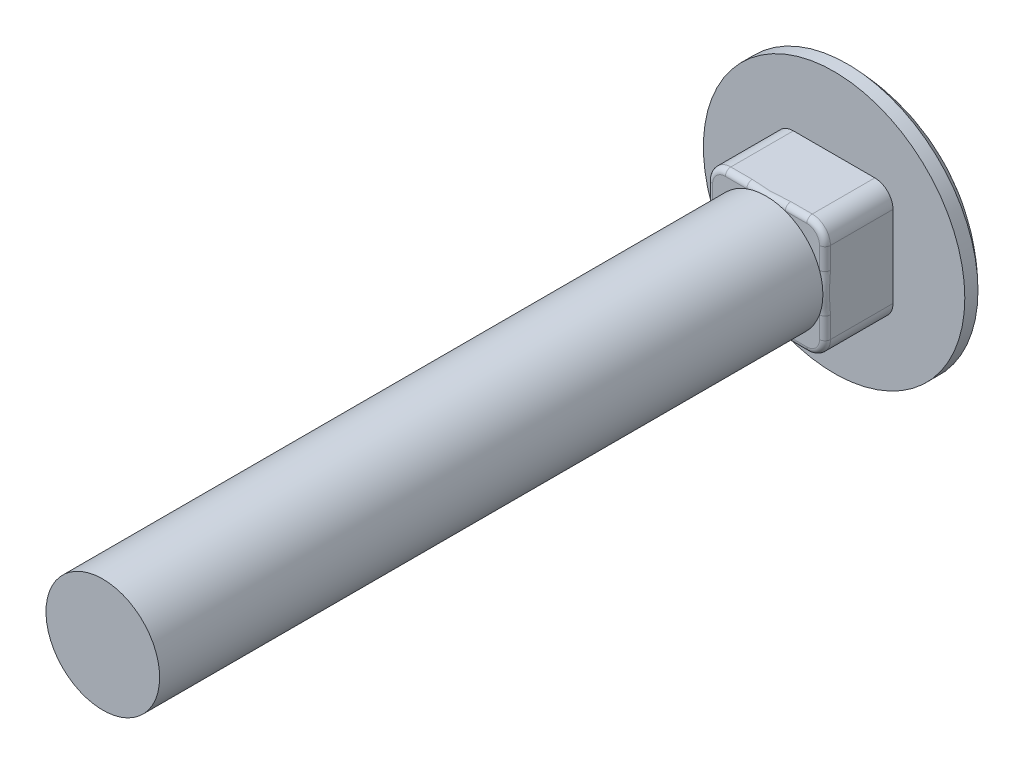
from build123d import *

# Parameters (mm, degrees)
SKETCH2_W      = 8.2296
SKETCH2_H      = 8.2296
EXTRUDE1_DEPTH = 4.7498
SKETCH3_R      = 3.96875
EXTRUDE2_DEPTH = 46.3296
FILLET1_R      = 1.27
FILLET2_R      = 0.381


with BuildPart() as part:
    # Sketch1 → Revolve1 (revolve)
    with BuildSketch(Plane(origin=(0, 0, 0), x_dir=(0, 0, -1), z_dir=(1, 0, 0)), mode=Mode.PRIVATE) as revolve1_sk:
        with BuildLine():
            Line((0, 0), (4.4704, 0))
            ThreePointArc((4.4704, 0), (3.611515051, 4.921707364), (0.92075, 9.1313))
            Line((0.92075, 9.1313), (0, 9.1313))
            Line((0, 9.1313), (0, 0))
        make_face()
    revolve(revolve1_sk.sketch.rotate(Axis((0, 0, 0), (0, 0, -1)), 90), axis=Axis((0, 0, 0), (0, 0, -1)))

    # Sketch2 → Extrude1 (add)
    with BuildSketch(Plane.XY):
        Rectangle(SKETCH2_W, SKETCH2_H)
    extrude(amount=EXTRUDE1_DEPTH)

    # Sketch3 → Extrude2 (add)
    with BuildSketch(Plane.XY.offset(4.7498)):
        Circle(SKETCH3_R)
    extrude(amount=EXTRUDE2_DEPTH)

    # Fillet1
    fillet1_edges = [part.edges().sort_by_distance(p)[0] for p in [
        (-4.1148, 4.1148, 2.3749),
        (-4.1148, -4.1148, 2.3749),
        (4.1148, -4.1148, 2.3749),
        (4.1148, 4.1148, 2.3749),
    ]]
    fillet(fillet1_edges, radius=FILLET1_R)

    # Fillet2
    fillet2_edges = [part.edges().sort_by_distance(p)[0] for p in [
        (-4.1148, 0, 4.7498),
        (0, 4.1148, 4.7498),
        (0, -4.1148, 4.7498),
        (4.1148, 0, 4.7498),
        (3.742825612, 3.742825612, 4.7498),
        (3.742825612, -3.742825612, 4.7498),
        (-3.742825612, -3.742825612, 4.7498),
        (-3.742825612, 3.742825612, 4.7498),
    ]]
    fillet(fillet2_edges, radius=FILLET2_R)


solid = part.part
